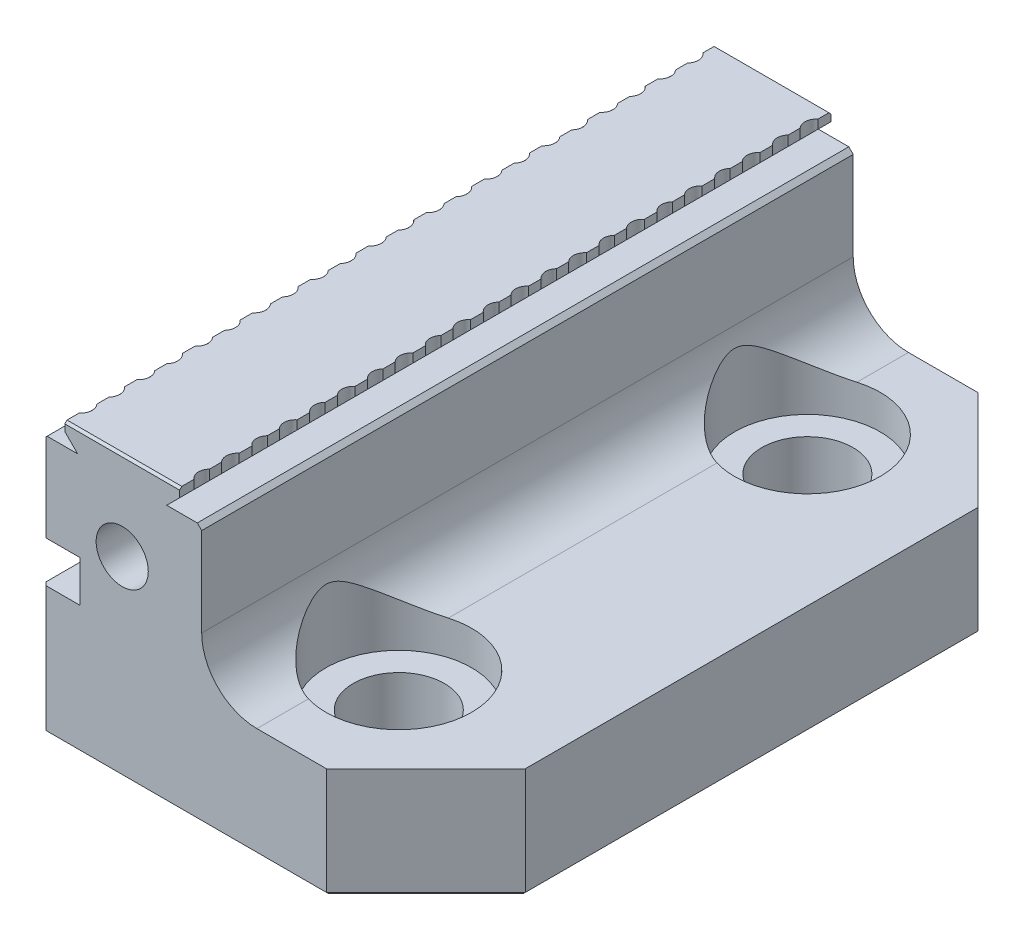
from build123d import *

# Parameters (mm, degrees)
BOSS_EXTRUDE1_DEPTH                = 37.465
CUT_EXTRUDE1_JAW_TOOTH_REACH       = 56.127
LPATTERN1_COUNT                    = 11
LPATTERN1_PITCH                    = 6.6548
CBORE_FOR_M10_SHCS1_D              = 10.5
CBORE_FOR_M10_SHCS1_CBORE_D        = 16.764
CBORE_FOR_M10_SHCS1_CBORE_DEPTH    = 23.495
F_6_0MM_DOWEL_HOLE1_D              = 8.0127
F_6_0MM_DOWEL_HOLE1_DEPTH          = 6.858
CHAMFER1_SIZE                      = 11.43
CHAMFER2_SIZE                      = 0.254
SKETCH9_W                          = 4.318
SKETCH9_H                          = 4.7498
CUT_EXTRUDE1_STOP_GROOVE_DEPTH     = 80.750666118
OUTSIDE_DOVETAIL_CHAMFER_SIZE      = 0.508
INSIDE_DOVETAIL_CHAMFER_SIZE       = 0.508
BOTTOM_OUTSIDE_EDGE_CHAMFER_SIZE   = 0.381
OUTSIDE_JAW_FACE_EDGE_CHAMFER_SIZE = 0.381
FRONT_JAW_FACE_CHAMFERED_EDGE_SIZE = 0.381


with BuildPart() as part:
    # Sketch1 → Boss-Extrude1 (new, symmetric)
    with BuildSketch(Plane.XY):
        with BuildLine():
            Line((-22.0345, -16.129), (22.0345, -16.129))
            Line((22.0345, -16.129), (22.0345, -3.429))
            Line((22.0345, -3.429), (2.6035, -3.429))
            ThreePointArc((2.6035, -3.429), (-1.886628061, -1.569128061), (-3.7465, 2.921))
            Line((-3.7465, 2.921), (-3.7465, 13.629))
            Line((-3.7465, 13.629), (-7.7705, 13.629))
            Line((-7.7705, 13.629), (-6.2865, 15.113))
            Line((-6.2865, 15.113), (-6.2865, 16.129))
            Line((-6.2865, 16.129), (-19.4945, 16.129))
            Line((-19.4945, 16.129), (-19.4945, 15.113))
            Line((-19.4945, 15.113), (-18.0105, 13.629))
            Line((-18.0105, 13.629), (-22.0345, 13.629))
            Line((-22.0345, 13.629), (-22.0345, -16.129))
        make_face()
    extrude(amount=BOSS_EXTRUDE1_DEPTH, both=True)

    # Sketch8 → Cut-Extrude1 JAW TOOTH (cut, up to next)
    with BuildSketch(Plane(origin=(0, 16.129, 0), x_dir=(1, 0, 0), z_dir=(0, 1, 0)), mode=Mode.PRIVATE) as cut_extrude1_jaw_tooth_sk1:
        with BuildLine():
            Line((-19.4945, 37.465), (-19.4945, 35.941))
            ThreePointArc((-19.4945, 35.941), (-19.015440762, 35.013590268), (-19.3675, 34.03092))
            Line((-19.3675, 34.03092), (-19.3675, 32.64408))
            ThreePointArc((-19.3675, 32.64408), (-19.015440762, 31.661409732), (-19.4945, 30.734))
            Line((-19.4945, 30.734), (-22.233870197, 30.734))
            Line((-22.233870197, 30.734), (-22.233870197, 37.465))
            Line((-22.233870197, 37.465), (-19.4945, 37.465))
        make_face()
    cut_extrude1_jaw_tooth_tool1 = extrude(cut_extrude1_jaw_tooth_sk1.sketch, amount=-CUT_EXTRUDE1_JAW_TOOTH_REACH, mode=Mode.PRIVATE) & part.part
    # Sketch8 → Cut-Extrude1 JAW TOOTH (cut, up to next)
    with BuildSketch(Plane(origin=(0, 16.129, 0), x_dir=(1, 0, 0), z_dir=(0, 1, 0)), mode=Mode.PRIVATE) as cut_extrude1_jaw_tooth_sk2:
        with BuildLine():
            Line((-3.547129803, 37.465), (-6.2865, 37.465))
            Line((-6.2865, 37.465), (-6.2865, 35.941))
            ThreePointArc((-6.2865, 35.941), (-6.765559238, 35.013590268), (-6.4135, 34.03092))
            Line((-6.4135, 34.03092), (-6.4135, 32.64408))
            ThreePointArc((-6.4135, 32.64408), (-6.765559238, 31.661409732), (-6.2865, 30.734))
            Line((-6.2865, 30.734), (-3.547129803, 30.734))
            Line((-3.547129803, 30.734), (-3.547129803, 37.465))
        make_face()
    cut_extrude1_jaw_tooth_tool2 = extrude(cut_extrude1_jaw_tooth_sk2.sketch, amount=-CUT_EXTRUDE1_JAW_TOOTH_REACH, mode=Mode.PRIVATE) & part.part
    cut_extrude1_jaw_tooth_1 = cut_extrude1_jaw_tooth_tool1.solids().sort_by_distance((-20.745914, 16.129, -34.041435))[0]
    add(cut_extrude1_jaw_tooth_1, mode=Mode.SUBTRACT)
    cut_extrude1_jaw_tooth_2 = cut_extrude1_jaw_tooth_tool2.solids().sort_by_distance((-5.035086, 16.129, -34.041435))[0]
    add(cut_extrude1_jaw_tooth_2, mode=Mode.SUBTRACT)
    cut_extrude1_jaw_tooth = cut_extrude1_jaw_tooth_1 + cut_extrude1_jaw_tooth_2  # Cut-Extrude1 JAW TOOTH as one shape, for the pattern or mirror that repeats it

    # LPattern1: Cut-Extrude1 JAW TOOTH ×11
    with Locations(*[(0, 0, i * LPATTERN1_PITCH) for i in range(1, LPATTERN1_COUNT)]):
        add(cut_extrude1_jaw_tooth, mode=Mode.SUBTRACT)

    # CBORE for M10 SHCS1 (through all)
    with Locations(Plane(origin=(0, 16.129, 0), x_dir=(-1, 0, 0), z_dir=(0, 1, 0))):
        with Locations((-4.953, -23.495), (-4.953, 23.495)):
            CounterBoreHole(CBORE_FOR_M10_SHCS1_D / 2, CBORE_FOR_M10_SHCS1_CBORE_D / 2, CBORE_FOR_M10_SHCS1_CBORE_DEPTH)

    # 6.0mm Dowel Hole1
    with Locations(Plane.XZ.offset(16.129)):
        with Locations((16.653, 23.5), (-6.747, -23.5)):
            Hole(F_6_0MM_DOWEL_HOLE1_D / 2, depth=F_6_0MM_DOWEL_HOLE1_DEPTH)

    # Chamfer1
    chamfer1_edges = [part.edges().sort_by_distance(p)[0] for p in [
        (22.0345, -9.779, 37.465),
        (22.0345, -9.779, -37.465),
    ]]
    chamfer(chamfer1_edges, length=CHAMFER1_SIZE)

    # Chamfer2
    chamfer2_edges = [part.edges().sort_by_distance(p)[0] for p in [
        (-12.8905, 16.129, -37.465),
        (-12.8905, 16.129, 37.465),
    ]]
    chamfer(chamfer2_edges, length=CHAMFER2_SIZE)

    # Sketch9 → Cut-Extrude1 STOP GROOVE (cut, through all)
    with BuildSketch(Plane(origin=(0, 0, -37.465), x_dir=(-1, 0, 0), z_dir=(0, 0, -1))):
        with Locations((19.8755, 1.0541)):
            Rectangle(SKETCH9_W, SKETCH9_H)
    extrude(amount=-CUT_EXTRUDE1_STOP_GROOVE_DEPTH, mode=Mode.SUBTRACT)

    # Sketch13 → M6x1.0 Tapped Hole1 (revolve, cut)
    with BuildSketch(Plane(origin=(-12.8905, 5.969, -37.465), x_dir=(0, 1, 0), z_dir=(1, 0, 0))):
        Polygon((0, 0), (0, 16.488151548), (2.5, 14.986), (2.5, 11.9888), (3, 11.9888), (3, 0), align=None)
    m6x1_0_tapped_hole1 = revolve(axis=Axis((-12.8905, 5.969, -43.815), (0, 0, 1)), mode=Mode.SUBTRACT)

    # Mirror1: M6x1.0 Tapped Hole1 across plane
    add(m6x1_0_tapped_hole1.mirror(Plane.XY), mode=Mode.SUBTRACT)

    # OUTSIDE DOVETAIL CHAMFER
    outside_dovetail_chamfer_edges = [part.edges().sort_by_distance(p)[0] for p in [
        (-22.0345, 13.629, 0),
    ]]
    chamfer(outside_dovetail_chamfer_edges, length=OUTSIDE_DOVETAIL_CHAMFER_SIZE)

    # INSIDE DOVETAIL CHAMFER
    inside_dovetail_chamfer_edges = [part.edges().sort_by_distance(p)[0] for p in [
        (-3.7465, 13.629, 0),
    ]]
    chamfer(inside_dovetail_chamfer_edges, length=INSIDE_DOVETAIL_CHAMFER_SIZE)

    # BOTTOM OUTSIDE EDGE CHAMFER
    bottom_outside_edge_chamfer_edges = [part.edges().sort_by_distance(p)[0] for p in [
        (-5.715, -16.129, -37.465),
        (-0.297, -16.129, 23.495),
        (-0.297, -16.129, -23.495),
        (22.0345, -16.129, 0),
        (16.3195, -16.129, 31.75),
        (16.3195, -16.129, -31.75),
        (-5.715, -16.129, 37.465),
    ]]
    chamfer(bottom_outside_edge_chamfer_edges, length=BOTTOM_OUTSIDE_EDGE_CHAMFER_SIZE)

    # OUTSIDE JAW FACE EDGE CHAMFER
    outside_jaw_face_edge_chamfer_edges = [part.edges().sort_by_distance(p)[0] for p in [
        (-22.0345, 8.275, -37.465),
        (-22.0345, -8.5344, -37.465),
        (-22.0345, 8.275, 37.465),
        (-22.0345, -8.5344, 37.465),
    ]]
    chamfer(outside_jaw_face_edge_chamfer_edges, length=OUTSIDE_JAW_FACE_EDGE_CHAMFER_SIZE)

    # FRONT JAW FACE CHAMFERED EDGE
    front_jaw_face_chamfered_edge_edges = [part.edges().sort_by_distance(p)[0] for p in [
        (-22.0345, -16.129, 0),
    ]]
    chamfer(front_jaw_face_chamfered_edge_edges, length=FRONT_JAW_FACE_CHAMFERED_EDGE_SIZE)


solid = part.part
